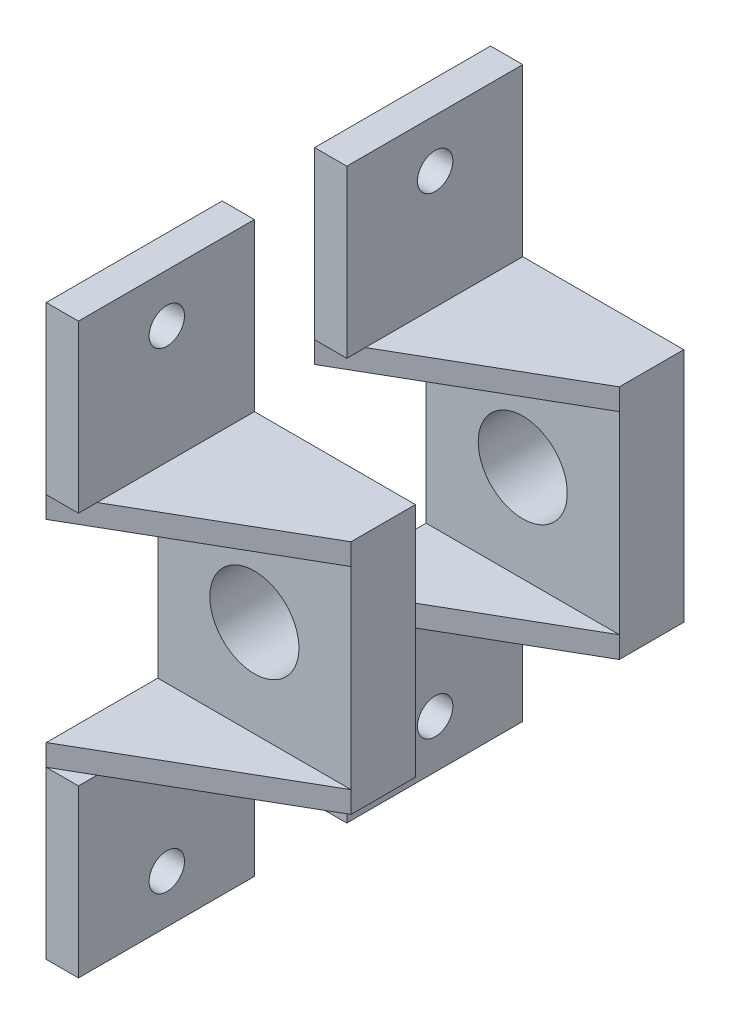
ISO-10303-21;
HEADER;
FILE_DESCRIPTION(('STEP AP214'),'2;1');
FILE_NAME('part.step','',(''),(''),'','','');
FILE_SCHEMA(('AUTOMOTIVE_DESIGN { 1 0 10303 214 1 1 1 1 }'));
ENDSEC;
DATA;
#1=APPLICATION_CONTEXT('core data for automotive mechanical design processes');
#2=APPLICATION_PROTOCOL_DEFINITION('international standard','automotive_design',2000,#1);
#3=PRODUCT_CONTEXT('',#1,'mechanical');
#4=PRODUCT('Part','Part','',(#3));
#5=PRODUCT_RELATED_PRODUCT_CATEGORY('part','',(#4));
#6=PRODUCT_DEFINITION_FORMATION('','',#4);
#7=PRODUCT_DEFINITION_CONTEXT('part definition',#1,'design');
#8=PRODUCT_DEFINITION('design','',#6,#7);
#9=PRODUCT_DEFINITION_SHAPE('','',#8);
#10=(LENGTH_UNIT() NAMED_UNIT(*) SI_UNIT(.MILLI.,.METRE.));
#11=(NAMED_UNIT(*) PLANE_ANGLE_UNIT() SI_UNIT($,.RADIAN.));
#12=(NAMED_UNIT(*) SI_UNIT($,.STERADIAN.) SOLID_ANGLE_UNIT());
#13=UNCERTAINTY_MEASURE_WITH_UNIT(LENGTH_MEASURE(1.E-05),#10,'distance_accuracy_value','');
#14=(GEOMETRIC_REPRESENTATION_CONTEXT(3) GLOBAL_UNCERTAINTY_ASSIGNED_CONTEXT((#13)) GLOBAL_UNIT_ASSIGNED_CONTEXT((#10,
#11,#12)) REPRESENTATION_CONTEXT('',''));
#15=CARTESIAN_POINT('',(0.,0.,0.));
#16=DIRECTION('',(0.,0.,1.));
#17=DIRECTION('',(1.,0.,0.));
#18=AXIS2_PLACEMENT_3D('',#15,#16,#17);
#19=CARTESIAN_POINT('',(24.,11.,-8.));
#20=DIRECTION('',(0.,-1.,0.));
#21=DIRECTION('',(0.,0.,-1.));
#22=AXIS2_PLACEMENT_3D('',#19,#20,#21);
#23=PLANE('',#22);
#24=DIRECTION('',(0.,0.,-1.));
#25=VECTOR('',#24,1.);
#26=CARTESIAN_POINT('',(9.,11.,8.39230484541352));
#27=LINE('',#26,#25);
#28=CARTESIAN_POINT('',(9.,11.,6.66025403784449));
#29=VERTEX_POINT('',#28);
#30=CARTESIAN_POINT('',(9.,11.,-8.));
#31=VERTEX_POINT('',#30);
#32=EDGE_CURVE('E200',#29,#31,#27,.T.);
#33=ORIENTED_EDGE('',*,*,#32,.F.);
#34=DIRECTION('',(0.866025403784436,0.,-0.500000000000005));
#35=VECTOR('',#34,1.);
#36=CARTESIAN_POINT('',(6.,11.,8.39230484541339));
#37=LINE('',#36,#35);
#38=CARTESIAN_POINT('',(24.,11.,-2.));
#39=VERTEX_POINT('',#38);
#40=EDGE_CURVE('E249',#29,#39,#37,.T.);
#41=ORIENTED_EDGE('',*,*,#40,.T.);
#42=DIRECTION('',(0.,0.,1.));
#43=VECTOR('',#42,1.);
#44=CARTESIAN_POINT('',(24.,11.,-8.));
#45=LINE('',#44,#43);
#46=CARTESIAN_POINT('',(24.,11.,-8.));
#47=VERTEX_POINT('',#46);
#48=EDGE_CURVE('E256',#47,#39,#45,.T.);
#49=ORIENTED_EDGE('',*,*,#48,.F.);
#50=DIRECTION('',(-1.,0.,0.));
#51=VECTOR('',#50,1.);
#52=CARTESIAN_POINT('',(24.,11.,-8.));
#53=LINE('',#52,#51);
#54=EDGE_CURVE('E245',#47,#31,#53,.T.);
#55=ORIENTED_EDGE('',*,*,#54,.T.);
#56=EDGE_LOOP('',(#33,#41,#49,#55));
#57=FACE_BOUND('',#56,.T.);
#58=ADVANCED_FACE('F57',(#57),#23,.F.);
#59=CARTESIAN_POINT('',(24.,-11.,-2.));
#60=DIRECTION('',(0.,0.,-1.));
#61=DIRECTION('',(-1.,0.,0.));
#62=AXIS2_PLACEMENT_3D('',#59,#60,#61);
#63=PLANE('',#62);
#64=CARTESIAN_POINT('',(15.,0.,-2.));
#65=DIRECTION('',(0.,0.,-1.));
#66=DIRECTION('',(-1.,0.,0.));
#67=AXIS2_PLACEMENT_3D('',#64,#65,#66);
#68=CIRCLE('',#67,4.15);
#69=CARTESIAN_POINT('',(10.85,0.,-2.));
#70=VERTEX_POINT('',#69);
#71=EDGE_CURVE('E292',#70,#70,#68,.F.);
#72=ORIENTED_EDGE('',*,*,#71,.F.);
#73=EDGE_LOOP('',(#72));
#74=FACE_BOUND('',#73,.T.);
#75=DIRECTION('',(0.,-1.,0.));
#76=VECTOR('',#75,1.);
#77=CARTESIAN_POINT('',(6.,-11.,-2.));
#78=LINE('',#77,#76);
#79=CARTESIAN_POINT('',(6.,9.,-2.));
#80=VERTEX_POINT('',#79);
#81=CARTESIAN_POINT('',(6.,-9.,-2.));
#82=VERTEX_POINT('',#81);
#83=EDGE_CURVE('E248',#80,#82,#78,.T.);
#84=ORIENTED_EDGE('',*,*,#83,.T.);
#85=DIRECTION('',(1.,0.,0.));
#86=VECTOR('',#85,1.);
#87=CARTESIAN_POINT('',(6.,-9.,-2.));
#88=LINE('',#87,#86);
#89=CARTESIAN_POINT('',(24.,-9.,-2.));
#90=VERTEX_POINT('',#89);
#91=EDGE_CURVE('E255',#82,#90,#88,.T.);
#92=ORIENTED_EDGE('',*,*,#91,.T.);
#93=DIRECTION('',(0.,-1.,0.));
#94=VECTOR('',#93,1.);
#95=CARTESIAN_POINT('',(24.,-11.,-2.));
#96=LINE('',#95,#94);
#97=CARTESIAN_POINT('',(24.,9.,-2.));
#98=VERTEX_POINT('',#97);
#99=EDGE_CURVE('E270',#98,#90,#96,.T.);
#100=ORIENTED_EDGE('',*,*,#99,.F.);
#101=DIRECTION('',(-1.,0.,0.));
#102=VECTOR('',#101,1.);
#103=CARTESIAN_POINT('',(24.,9.,-2.));
#104=LINE('',#103,#102);
#105=EDGE_CURVE('E275',#98,#80,#104,.T.);
#106=ORIENTED_EDGE('',*,*,#105,.T.);
#107=EDGE_LOOP('',(#84,#92,#100,#106));
#108=FACE_BOUND('',#107,.T.);
#109=ADVANCED_FACE('F372',(#74,#108),#63,.F.);
#110=CARTESIAN_POINT('',(24.,-11.,-8.));
#111=DIRECTION('',(0.,1.,0.));
#112=DIRECTION('',(0.,0.,1.));
#113=AXIS2_PLACEMENT_3D('',#110,#111,#112);
#114=PLANE('',#113);
#115=DIRECTION('',(-0.866025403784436,0.,0.500000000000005));
#116=VECTOR('',#115,1.);
#117=CARTESIAN_POINT('',(24.,-11.,-2.));
#118=LINE('',#117,#116);
#119=CARTESIAN_POINT('',(24.,-11.,-2.));
#120=VERTEX_POINT('',#119);
#121=CARTESIAN_POINT('',(9.,-11.,6.66025403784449));
#122=VERTEX_POINT('',#121);
#123=EDGE_CURVE('E159',#120,#122,#118,.T.);
#124=ORIENTED_EDGE('',*,*,#123,.T.);
#125=DIRECTION('',(0.,0.,1.));
#126=VECTOR('',#125,1.);
#127=CARTESIAN_POINT('',(9.,-11.,8.39230484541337));
#128=LINE('',#127,#126);
#129=CARTESIAN_POINT('',(9.,-11.,-8.));
#130=VERTEX_POINT('',#129);
#131=EDGE_CURVE('E153',#130,#122,#128,.T.);
#132=ORIENTED_EDGE('',*,*,#131,.F.);
#133=DIRECTION('',(-1.,0.,0.));
#134=VECTOR('',#133,1.);
#135=CARTESIAN_POINT('',(24.,-11.,-8.));
#136=LINE('',#135,#134);
#137=CARTESIAN_POINT('',(24.,-11.,-8.));
#138=VERTEX_POINT('',#137);
#139=EDGE_CURVE('E157',#138,#130,#136,.T.);
#140=ORIENTED_EDGE('',*,*,#139,.F.);
#141=DIRECTION('',(0.,0.,-1.));
#142=VECTOR('',#141,1.);
#143=CARTESIAN_POINT('',(24.,-11.,-8.));
#144=LINE('',#143,#142);
#145=EDGE_CURVE('E263',#120,#138,#144,.T.);
#146=ORIENTED_EDGE('',*,*,#145,.F.);
#147=EDGE_LOOP('',(#124,#132,#140,#146));
#148=FACE_BOUND('',#147,.T.);
#149=ADVANCED_FACE('F155',(#148),#114,.F.);
#150=CARTESIAN_POINT('',(24.,-11.,-8.));
#151=DIRECTION('',(0.,0.,1.));
#152=DIRECTION('',(1.,0.,0.));
#153=AXIS2_PLACEMENT_3D('',#150,#151,#152);
#154=PLANE('',#153);
#155=CARTESIAN_POINT('',(15.,0.,-8.));
#156=DIRECTION('',(0.,0.,-1.));
#157=DIRECTION('',(-1.,0.,0.));
#158=AXIS2_PLACEMENT_3D('',#155,#156,#157);
#159=CIRCLE('',#158,4.15);
#160=CARTESIAN_POINT('',(10.85,0.,-8.));
#161=VERTEX_POINT('',#160);
#162=EDGE_CURVE('E304',#161,#161,#159,.T.);
#163=ORIENTED_EDGE('',*,*,#162,.F.);
#164=EDGE_LOOP('',(#163));
#165=FACE_BOUND('',#164,.T.);
#166=DIRECTION('',(0.,1.,0.));
#167=VECTOR('',#166,1.);
#168=CARTESIAN_POINT('',(6.,-11.,-8.));
#169=LINE('',#168,#167);
#170=CARTESIAN_POINT('',(6.,-26.5,-8.));
#171=VERTEX_POINT('',#170);
#172=CARTESIAN_POINT('',(6.,26.5,-7.99999999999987));
#173=VERTEX_POINT('',#172);
#174=EDGE_CURVE('E75',#171,#173,#169,.T.);
#175=ORIENTED_EDGE('',*,*,#174,.T.);
#176=DIRECTION('',(-1.,0.,0.));
#177=VECTOR('',#176,1.);
#178=CARTESIAN_POINT('',(9.,26.5,-7.99999999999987));
#179=LINE('',#178,#177);
#180=CARTESIAN_POINT('',(9.,26.5,-7.99999999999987));
#181=VERTEX_POINT('',#180);
#182=EDGE_CURVE('E209',#181,#173,#179,.T.);
#183=ORIENTED_EDGE('',*,*,#182,.F.);
#184=DIRECTION('',(0.,1.,0.));
#185=VECTOR('',#184,1.);
#186=CARTESIAN_POINT('',(9.,26.5,-7.99999999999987));
#187=LINE('',#186,#185);
#188=EDGE_CURVE('E201',#31,#181,#187,.T.);
#189=ORIENTED_EDGE('',*,*,#188,.F.);
#190=ORIENTED_EDGE('',*,*,#54,.F.);
#191=DIRECTION('',(0.,1.,0.));
#192=VECTOR('',#191,1.);
#193=CARTESIAN_POINT('',(24.,-11.,-8.));
#194=LINE('',#193,#192);
#195=EDGE_CURVE('E170',#138,#47,#194,.T.);
#196=ORIENTED_EDGE('',*,*,#195,.F.);
#197=ORIENTED_EDGE('',*,*,#139,.T.);
#198=DIRECTION('',(0.,1.,0.));
#199=VECTOR('',#198,1.);
#200=CARTESIAN_POINT('',(9.,-11.,-8.));
#201=LINE('',#200,#199);
#202=CARTESIAN_POINT('',(9.,-26.5,-8.));
#203=VERTEX_POINT('',#202);
#204=EDGE_CURVE('E165',#203,#130,#201,.T.);
#205=ORIENTED_EDGE('',*,*,#204,.F.);
#206=DIRECTION('',(-1.,0.,0.));
#207=VECTOR('',#206,1.);
#208=CARTESIAN_POINT('',(9.,-26.5,-8.));
#209=LINE('',#208,#207);
#210=EDGE_CURVE('E172',#203,#171,#209,.T.);
#211=ORIENTED_EDGE('',*,*,#210,.T.);
#212=EDGE_LOOP('',(#175,#183,#189,#190,#196,#197,#205,#211));
#213=FACE_BOUND('',#212,.T.);
#214=ADVANCED_FACE('F168',(#165,#213),#154,.F.);
#215=CARTESIAN_POINT('',(24.,0.,0.));
#216=DIRECTION('',(1.,0.,0.));
#217=DIRECTION('',(0.,0.,-1.));
#218=AXIS2_PLACEMENT_3D('',#215,#216,#217);
#219=PLANE('',#218);
#220=EDGE_CURVE('E267',#39,#98,#96,.T.);
#221=ORIENTED_EDGE('',*,*,#220,.T.);
#222=ORIENTED_EDGE('',*,*,#99,.T.);
#223=DIRECTION('',(0.,-1.,0.));
#224=VECTOR('',#223,1.);
#225=CARTESIAN_POINT('',(24.,-9.,-2.));
#226=LINE('',#225,#224);
#227=EDGE_CURVE('E266',#90,#120,#226,.T.);
#228=ORIENTED_EDGE('',*,*,#227,.T.);
#229=ORIENTED_EDGE('',*,*,#145,.T.);
#230=ORIENTED_EDGE('',*,*,#195,.T.);
#231=ORIENTED_EDGE('',*,*,#48,.T.);
#232=EDGE_LOOP('',(#221,#222,#228,#229,#230,#231));
#233=FACE_BOUND('',#232,.T.);
#234=ADVANCED_FACE('F370',(#233),#219,.T.);
#235=CARTESIAN_POINT('',(6.,9.,8.39230484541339));
#236=DIRECTION('',(0.500000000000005,0.,0.866025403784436));
#237=DIRECTION('',(0.866025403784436,0.,-0.500000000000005));
#238=AXIS2_PLACEMENT_3D('',#235,#236,#237);
#239=PLANE('',#238);
#240=CARTESIAN_POINT('',(6.,11.,8.39230484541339));
#241=VERTEX_POINT('',#240);
#242=EDGE_CURVE('E221',#241,#29,#37,.T.);
#243=ORIENTED_EDGE('',*,*,#242,.F.);
#244=DIRECTION('',(0.,1.,0.));
#245=VECTOR('',#244,1.);
#246=CARTESIAN_POINT('',(6.,9.,8.39230484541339));
#247=LINE('',#246,#245);
#248=CARTESIAN_POINT('',(6.,9.,8.39230484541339));
#249=VERTEX_POINT('',#248);
#250=EDGE_CURVE('E12',#249,#241,#247,.T.);
#251=ORIENTED_EDGE('',*,*,#250,.F.);
#252=DIRECTION('',(0.866025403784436,0.,-0.500000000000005));
#253=VECTOR('',#252,1.);
#254=CARTESIAN_POINT('',(6.,9.,8.39230484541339));
#255=LINE('',#254,#253);
#256=EDGE_CURVE('E260',#249,#98,#255,.T.);
#257=ORIENTED_EDGE('',*,*,#256,.T.);
#258=ORIENTED_EDGE('',*,*,#220,.F.);
#259=ORIENTED_EDGE('',*,*,#40,.F.);
#260=EDGE_LOOP('',(#243,#251,#257,#258,#259));
#261=FACE_BOUND('',#260,.T.);
#262=ADVANCED_FACE('F362',(#261),#239,.T.);
#263=CARTESIAN_POINT('',(0.,9.,0.));
#264=DIRECTION('',(0.,-1.,0.));
#265=DIRECTION('',(0.,0.,-1.));
#266=AXIS2_PLACEMENT_3D('',#263,#264,#265);
#267=PLANE('',#266);
#268=DIRECTION('',(0.,0.,1.));
#269=VECTOR('',#268,1.);
#270=CARTESIAN_POINT('',(6.,9.,-2.));
#271=LINE('',#270,#269);
#272=EDGE_CURVE('E68',#80,#249,#271,.T.);
#273=ORIENTED_EDGE('',*,*,#272,.F.);
#274=ORIENTED_EDGE('',*,*,#105,.F.);
#275=ORIENTED_EDGE('',*,*,#256,.F.);
#276=EDGE_LOOP('',(#273,#274,#275));
#277=FACE_BOUND('',#276,.T.);
#278=ADVANCED_FACE('F378',(#277),#267,.T.);
#279=CARTESIAN_POINT('',(24.,-9.,-2.));
#280=DIRECTION('',(0.500000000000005,0.,0.866025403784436));
#281=DIRECTION('',(0.866025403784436,0.,-0.500000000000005));
#282=AXIS2_PLACEMENT_3D('',#279,#280,#281);
#283=PLANE('',#282);
#284=ORIENTED_EDGE('',*,*,#123,.F.);
#285=ORIENTED_EDGE('',*,*,#227,.F.);
#286=DIRECTION('',(-0.866025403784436,0.,0.500000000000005));
#287=VECTOR('',#286,1.);
#288=CARTESIAN_POINT('',(24.,-9.,-2.));
#289=LINE('',#288,#287);
#290=CARTESIAN_POINT('',(6.,-9.,8.39230484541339));
#291=VERTEX_POINT('',#290);
#292=EDGE_CURVE('E282',#90,#291,#289,.T.);
#293=ORIENTED_EDGE('',*,*,#292,.T.);
#294=DIRECTION('',(0.,-1.,0.));
#295=VECTOR('',#294,1.);
#296=CARTESIAN_POINT('',(6.,-9.,8.39230484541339));
#297=LINE('',#296,#295);
#298=CARTESIAN_POINT('',(6.,-11.,8.39230484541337));
#299=VERTEX_POINT('',#298);
#300=EDGE_CURVE('E288',#291,#299,#297,.T.);
#301=ORIENTED_EDGE('',*,*,#300,.T.);
#302=EDGE_CURVE('E187',#122,#299,#118,.T.);
#303=ORIENTED_EDGE('',*,*,#302,.F.);
#304=EDGE_LOOP('',(#284,#285,#293,#301,#303));
#305=FACE_BOUND('',#304,.T.);
#306=ADVANCED_FACE('F334',(#305),#283,.T.);
#307=CARTESIAN_POINT('',(0.,-9.,0.));
#308=DIRECTION('',(0.,1.,0.));
#309=DIRECTION('',(0.,0.,1.));
#310=AXIS2_PLACEMENT_3D('',#307,#308,#309);
#311=PLANE('',#310);
#312=ORIENTED_EDGE('',*,*,#91,.F.);
#313=DIRECTION('',(0.,0.,-1.));
#314=VECTOR('',#313,1.);
#315=CARTESIAN_POINT('',(6.,-9.,8.39230484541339));
#316=LINE('',#315,#314);
#317=EDGE_CURVE('E235',#291,#82,#316,.T.);
#318=ORIENTED_EDGE('',*,*,#317,.F.);
#319=ORIENTED_EDGE('',*,*,#292,.F.);
#320=EDGE_LOOP('',(#312,#318,#319));
#321=FACE_BOUND('',#320,.T.);
#322=ADVANCED_FACE('F375',(#321),#311,.T.);
#323=CARTESIAN_POINT('',(15.,0.,9.73797256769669));
#324=DIRECTION('',(0.,0.,-1.));
#325=DIRECTION('',(-1.,0.,0.));
#326=AXIS2_PLACEMENT_3D('',#323,#324,#325);
#327=CYLINDRICAL_SURFACE('',#326,4.15);
#328=CARTESIAN_POINT('',(10.85,0.,-2.));
#329=CARTESIAN_POINT('',(10.85,0.,-2.0625));
#330=CARTESIAN_POINT('',(10.85,0.,-2.125));
#331=CARTESIAN_POINT('',(10.85,0.,-2.25));
#332=CARTESIAN_POINT('',(10.85,0.,-2.3125));
#333=CARTESIAN_POINT('',(10.85,0.,-2.4375));
#334=CARTESIAN_POINT('',(10.85,0.,-2.5));
#335=CARTESIAN_POINT('',(10.85,0.,-2.625));
#336=CARTESIAN_POINT('',(10.85,0.,-2.6875));
#337=CARTESIAN_POINT('',(10.85,0.,-2.8125));
#338=CARTESIAN_POINT('',(10.85,0.,-2.875));
#339=CARTESIAN_POINT('',(10.85,0.,-3.));
#340=CARTESIAN_POINT('',(10.85,0.,-3.0625));
#341=CARTESIAN_POINT('',(10.85,0.,-3.1875));
#342=CARTESIAN_POINT('',(10.85,0.,-3.25));
#343=CARTESIAN_POINT('',(10.85,0.,-3.375));
#344=CARTESIAN_POINT('',(10.85,0.,-3.4375));
#345=CARTESIAN_POINT('',(10.85,0.,-3.5625));
#346=CARTESIAN_POINT('',(10.85,0.,-3.625));
#347=CARTESIAN_POINT('',(10.85,0.,-3.75));
#348=CARTESIAN_POINT('',(10.85,0.,-3.8125));
#349=CARTESIAN_POINT('',(10.85,0.,-3.9375));
#350=CARTESIAN_POINT('',(10.85,0.,-4.));
#351=CARTESIAN_POINT('',(10.85,0.,-4.125));
#352=CARTESIAN_POINT('',(10.85,0.,-4.1875));
#353=CARTESIAN_POINT('',(10.85,0.,-4.3125));
#354=CARTESIAN_POINT('',(10.85,0.,-4.375));
#355=CARTESIAN_POINT('',(10.85,0.,-4.5));
#356=CARTESIAN_POINT('',(10.85,0.,-4.5625));
#357=CARTESIAN_POINT('',(10.85,0.,-4.6875));
#358=CARTESIAN_POINT('',(10.85,0.,-4.75));
#359=CARTESIAN_POINT('',(10.85,0.,-4.875));
#360=CARTESIAN_POINT('',(10.85,0.,-4.9375));
#361=CARTESIAN_POINT('',(10.85,0.,-5.0625));
#362=CARTESIAN_POINT('',(10.85,0.,-5.125));
#363=CARTESIAN_POINT('',(10.85,0.,-5.25));
#364=CARTESIAN_POINT('',(10.85,0.,-5.3125));
#365=CARTESIAN_POINT('',(10.85,0.,-5.4375));
#366=CARTESIAN_POINT('',(10.85,0.,-5.5));
#367=CARTESIAN_POINT('',(10.85,0.,-5.625));
#368=CARTESIAN_POINT('',(10.85,0.,-5.6875));
#369=CARTESIAN_POINT('',(10.85,0.,-5.8125));
#370=CARTESIAN_POINT('',(10.85,0.,-5.875));
#371=CARTESIAN_POINT('',(10.85,0.,-6.));
#372=CARTESIAN_POINT('',(10.85,0.,-6.0625));
#373=CARTESIAN_POINT('',(10.85,0.,-6.1875));
#374=CARTESIAN_POINT('',(10.85,0.,-6.25));
#375=CARTESIAN_POINT('',(10.85,0.,-6.375));
#376=CARTESIAN_POINT('',(10.85,0.,-6.4375));
#377=CARTESIAN_POINT('',(10.85,0.,-6.5625));
#378=CARTESIAN_POINT('',(10.85,0.,-6.625));
#379=CARTESIAN_POINT('',(10.85,0.,-6.75));
#380=CARTESIAN_POINT('',(10.85,0.,-6.8125));
#381=CARTESIAN_POINT('',(10.85,0.,-6.9375));
#382=CARTESIAN_POINT('',(10.85,0.,-7.));
#383=CARTESIAN_POINT('',(10.85,0.,-7.125));
#384=CARTESIAN_POINT('',(10.85,0.,-7.1875));
#385=CARTESIAN_POINT('',(10.85,0.,-7.3125));
#386=CARTESIAN_POINT('',(10.85,0.,-7.375));
#387=CARTESIAN_POINT('',(10.85,0.,-7.5));
#388=CARTESIAN_POINT('',(10.85,0.,-7.5625));
#389=CARTESIAN_POINT('',(10.85,0.,-7.6875));
#390=CARTESIAN_POINT('',(10.85,0.,-7.75));
#391=CARTESIAN_POINT('',(10.85,0.,-7.875));
#392=CARTESIAN_POINT('',(10.85,0.,-7.9375));
#393=CARTESIAN_POINT('',(10.85,0.,-8.));
#394=B_SPLINE_CURVE_WITH_KNOTS('',3,(#328,#329,#330,#331,#332,#333,#334,#335,#336,#337,#338,
#339,#340,#341,#342,#343,#344,#345,#346,#347,#348,#349,#350,#351,#352,#353,#354,#355,#356,#357,
#358,#359,#360,#361,#362,#363,#364,#365,#366,#367,#368,#369,#370,#371,#372,#373,#374,#375,#376,
#377,#378,#379,#380,#381,#382,#383,#384,#385,#386,#387,#388,#389,#390,#391,#392,#393),
.UNSPECIFIED.,.F.,.F.,(4,2,2,2,2,2,2,2,2,2,2,2,2,2,2,2,2,2,2,2,2,2,2,2,2,2,2,2,2,2,2,2,4),(0.,
0.1875,0.375,0.5625,0.750000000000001,0.937500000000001,1.125,1.3125,1.5,1.6875,1.875,2.0625,
2.25,2.4375,2.625,2.8125,3.,3.1875,3.375,3.5625,3.75,3.9375,4.125,4.3125,4.5,4.6875,4.875,
5.0625,5.25,5.4375,5.625,5.8125,6.),.UNSPECIFIED.);
#395=EDGE_CURVE('BSEAM407',#70,#161,#394,.T.);
#396=ORIENTED_EDGE('',*,*,#71,.T.);
#397=ORIENTED_EDGE('',*,*,#162,.T.);
#398=ORIENTED_EDGE('',*,*,#395,.T.);
#399=ORIENTED_EDGE('',*,*,#395,.F.);
#400=EDGE_LOOP('',(#396,#398,#397,#399));
#401=FACE_BOUND('',#400,.T.);
#402=ADVANCED_FACE('F407',(#401),#327,.F.);
#403=CARTESIAN_POINT('',(9.,-11.,8.39230484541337));
#404=DIRECTION('',(0.,0.,-1.));
#405=DIRECTION('',(0.,1.,0.));
#406=AXIS2_PLACEMENT_3D('',#403,#404,#405);
#407=PLANE('',#406);
#408=DIRECTION('',(0.,-1.,0.));
#409=VECTOR('',#408,1.);
#410=CARTESIAN_POINT('',(6.,-11.,8.39230484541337));
#411=LINE('',#410,#409);
#412=CARTESIAN_POINT('',(6.,-26.5,8.39230484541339));
#413=VERTEX_POINT('',#412);
#414=EDGE_CURVE('E308',#299,#413,#411,.T.);
#415=ORIENTED_EDGE('',*,*,#414,.T.);
#416=DIRECTION('',(-1.,0.,0.));
#417=VECTOR('',#416,1.);
#418=CARTESIAN_POINT('',(9.,-26.5,8.39230484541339));
#419=LINE('',#418,#417);
#420=CARTESIAN_POINT('',(9.,-26.5,8.39230484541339));
#421=VERTEX_POINT('',#420);
#422=EDGE_CURVE('E309',#421,#413,#419,.T.);
#423=ORIENTED_EDGE('',*,*,#422,.F.);
#424=DIRECTION('',(0.,-1.,0.));
#425=VECTOR('',#424,1.);
#426=CARTESIAN_POINT('',(9.,-11.,8.39230484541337));
#427=LINE('',#426,#425);
#428=CARTESIAN_POINT('',(9.,-11.,8.39230484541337));
#429=VERTEX_POINT('',#428);
#430=EDGE_CURVE('E181',#429,#421,#427,.T.);
#431=ORIENTED_EDGE('',*,*,#430,.F.);
#432=DIRECTION('',(-1.,0.,0.));
#433=VECTOR('',#432,1.);
#434=CARTESIAN_POINT('',(9.,-11.,8.39230484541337));
#435=LINE('',#434,#433);
#436=EDGE_CURVE('E316',#429,#299,#435,.T.);
#437=ORIENTED_EDGE('',*,*,#436,.T.);
#438=EDGE_LOOP('',(#415,#423,#431,#437));
#439=FACE_BOUND('',#438,.T.);
#440=ADVANCED_FACE('F326',(#439),#407,.F.);
#441=CARTESIAN_POINT('',(9.,-26.5,8.39230484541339));
#442=DIRECTION('',(0.,1.,0.));
#443=DIRECTION('',(0.,0.,1.));
#444=AXIS2_PLACEMENT_3D('',#441,#442,#443);
#445=PLANE('',#444);
#446=DIRECTION('',(0.,0.,-1.));
#447=VECTOR('',#446,1.);
#448=CARTESIAN_POINT('',(6.,-26.5,8.39230484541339));
#449=LINE('',#448,#447);
#450=EDGE_CURVE('E313',#413,#171,#449,.T.);
#451=ORIENTED_EDGE('',*,*,#450,.T.);
#452=ORIENTED_EDGE('',*,*,#210,.F.);
#453=DIRECTION('',(0.,0.,-1.));
#454=VECTOR('',#453,1.);
#455=CARTESIAN_POINT('',(9.,-26.5,8.39230484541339));
#456=LINE('',#455,#454);
#457=EDGE_CURVE('E176',#421,#203,#456,.T.);
#458=ORIENTED_EDGE('',*,*,#457,.F.);
#459=ORIENTED_EDGE('',*,*,#422,.T.);
#460=EDGE_LOOP('',(#451,#452,#458,#459));
#461=FACE_BOUND('',#460,.T.);
#462=ADVANCED_FACE('F415',(#461),#445,.F.);
#463=CARTESIAN_POINT('',(9.,-11.,8.39230484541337));
#464=DIRECTION('',(0.,-1.,0.));
#465=DIRECTION('',(0.,0.,-1.));
#466=AXIS2_PLACEMENT_3D('',#463,#464,#465);
#467=PLANE('',#466);
#468=ORIENTED_EDGE('',*,*,#302,.T.);
#469=ORIENTED_EDGE('',*,*,#436,.F.);
#470=EDGE_CURVE('E164',#122,#429,#128,.T.);
#471=ORIENTED_EDGE('',*,*,#470,.F.);
#472=EDGE_LOOP('',(#468,#469,#471));
#473=FACE_BOUND('',#472,.T.);
#474=ADVANCED_FACE('F338',(#473),#467,.F.);
#475=CARTESIAN_POINT('',(9.,0.,0.));
#476=DIRECTION('',(1.,0.,0.));
#477=DIRECTION('',(0.,0.,-1.));
#478=AXIS2_PLACEMENT_3D('',#475,#476,#477);
#479=PLANE('',#478);
#480=CARTESIAN_POINT('',(9.,-22.,0.160287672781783));
#481=DIRECTION('',(1.,0.,0.));
#482=DIRECTION('',(0.,0.,-1.));
#483=AXIS2_PLACEMENT_3D('',#480,#481,#482);
#484=CIRCLE('',#483,1.6499999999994);
#485=CARTESIAN_POINT('',(9.,-22.,-1.48971232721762));
#486=VERTEX_POINT('',#485);
#487=EDGE_CURVE('E230',#486,#486,#484,.T.);
#488=ORIENTED_EDGE('',*,*,#487,.F.);
#489=EDGE_LOOP('',(#488));
#490=FACE_BOUND('',#489,.T.);
#491=ORIENTED_EDGE('',*,*,#430,.T.);
#492=ORIENTED_EDGE('',*,*,#457,.T.);
#493=ORIENTED_EDGE('',*,*,#204,.T.);
#494=ORIENTED_EDGE('',*,*,#131,.T.);
#495=ORIENTED_EDGE('',*,*,#470,.T.);
#496=EDGE_LOOP('',(#491,#492,#493,#494,#495));
#497=FACE_BOUND('',#496,.T.);
#498=ADVANCED_FACE('F175',(#490,#497),#479,.T.);
#499=CARTESIAN_POINT('',(9.,26.5,8.39230484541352));
#500=DIRECTION('',(0.,-1.,0.));
#501=DIRECTION('',(0.,0.,-1.));
#502=AXIS2_PLACEMENT_3D('',#499,#500,#501);
#503=PLANE('',#502);
#504=DIRECTION('',(0.,0.,1.));
#505=VECTOR('',#504,1.);
#506=CARTESIAN_POINT('',(6.,26.5,8.39230484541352));
#507=LINE('',#506,#505);
#508=CARTESIAN_POINT('',(6.,26.5,8.39230484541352));
#509=VERTEX_POINT('',#508);
#510=EDGE_CURVE('E205',#173,#509,#507,.T.);
#511=ORIENTED_EDGE('',*,*,#510,.T.);
#512=DIRECTION('',(-1.,0.,0.));
#513=VECTOR('',#512,1.);
#514=CARTESIAN_POINT('',(9.,26.5,8.39230484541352));
#515=LINE('',#514,#513);
#516=CARTESIAN_POINT('',(9.,26.5,8.39230484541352));
#517=VERTEX_POINT('',#516);
#518=EDGE_CURVE('E213',#517,#509,#515,.T.);
#519=ORIENTED_EDGE('',*,*,#518,.F.);
#520=DIRECTION('',(0.,0.,1.));
#521=VECTOR('',#520,1.);
#522=CARTESIAN_POINT('',(9.,26.5,8.39230484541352));
#523=LINE('',#522,#521);
#524=EDGE_CURVE('E188',#181,#517,#523,.T.);
#525=ORIENTED_EDGE('',*,*,#524,.F.);
#526=ORIENTED_EDGE('',*,*,#182,.T.);
#527=EDGE_LOOP('',(#511,#519,#525,#526));
#528=FACE_BOUND('',#527,.T.);
#529=ADVANCED_FACE('F353',(#528),#503,.F.);
#530=CARTESIAN_POINT('',(9.,26.5,8.39230484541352));
#531=DIRECTION('',(0.,0.,-1.));
#532=DIRECTION('',(0.,1.,0.));
#533=AXIS2_PLACEMENT_3D('',#530,#531,#532);
#534=PLANE('',#533);
#535=DIRECTION('',(0.,-1.,0.));
#536=VECTOR('',#535,1.);
#537=CARTESIAN_POINT('',(6.,26.5,8.39230484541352));
#538=LINE('',#537,#536);
#539=EDGE_CURVE('E210',#509,#241,#538,.T.);
#540=ORIENTED_EDGE('',*,*,#539,.T.);
#541=DIRECTION('',(-1.,0.,0.));
#542=VECTOR('',#541,1.);
#543=CARTESIAN_POINT('',(9.,11.,8.39230484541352));
#544=LINE('',#543,#542);
#545=CARTESIAN_POINT('',(9.,11.,8.39230484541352));
#546=VERTEX_POINT('',#545);
#547=EDGE_CURVE('E217',#546,#241,#544,.T.);
#548=ORIENTED_EDGE('',*,*,#547,.F.);
#549=DIRECTION('',(0.,-1.,0.));
#550=VECTOR('',#549,1.);
#551=CARTESIAN_POINT('',(9.,26.5,8.39230484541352));
#552=LINE('',#551,#550);
#553=EDGE_CURVE('E192',#517,#546,#552,.T.);
#554=ORIENTED_EDGE('',*,*,#553,.F.);
#555=ORIENTED_EDGE('',*,*,#518,.T.);
#556=EDGE_LOOP('',(#540,#548,#554,#555));
#557=FACE_BOUND('',#556,.T.);
#558=ADVANCED_FACE('F356',(#557),#534,.F.);
#559=CARTESIAN_POINT('',(9.,11.,8.39230484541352));
#560=DIRECTION('',(0.,1.,0.));
#561=DIRECTION('',(0.,0.,1.));
#562=AXIS2_PLACEMENT_3D('',#559,#560,#561);
#563=PLANE('',#562);
#564=ORIENTED_EDGE('',*,*,#242,.T.);
#565=EDGE_CURVE('E196',#546,#29,#27,.T.);
#566=ORIENTED_EDGE('',*,*,#565,.F.);
#567=ORIENTED_EDGE('',*,*,#547,.T.);
#568=EDGE_LOOP('',(#564,#566,#567));
#569=FACE_BOUND('',#568,.T.);
#570=ADVANCED_FACE('F358',(#569),#563,.F.);
#571=CARTESIAN_POINT('',(9.,0.,0.));
#572=DIRECTION('',(-1.,0.,0.));
#573=DIRECTION('',(0.,0.,1.));
#574=AXIS2_PLACEMENT_3D('',#571,#572,#573);
#575=PLANE('',#574);
#576=CARTESIAN_POINT('',(9.,22.,0.160287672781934));
#577=DIRECTION('',(-1.,0.,0.));
#578=DIRECTION('',(0.,0.,1.));
#579=AXIS2_PLACEMENT_3D('',#576,#577,#578);
#580=CIRCLE('',#579,1.6499999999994);
#581=CARTESIAN_POINT('',(9.,22.,1.81028767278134));
#582=VERTEX_POINT('',#581);
#583=EDGE_CURVE('E193',#582,#582,#580,.T.);
#584=ORIENTED_EDGE('',*,*,#583,.T.);
#585=EDGE_LOOP('',(#584));
#586=FACE_BOUND('',#585,.T.);
#587=ORIENTED_EDGE('',*,*,#524,.T.);
#588=ORIENTED_EDGE('',*,*,#553,.T.);
#589=ORIENTED_EDGE('',*,*,#565,.T.);
#590=ORIENTED_EDGE('',*,*,#32,.T.);
#591=ORIENTED_EDGE('',*,*,#188,.T.);
#592=EDGE_LOOP('',(#587,#588,#589,#590,#591));
#593=FACE_BOUND('',#592,.T.);
#594=ADVANCED_FACE('F346',(#586,#593),#575,.F.);
#595=CARTESIAN_POINT('',(6.,0.,0.));
#596=DIRECTION('',(-1.,0.,0.));
#597=DIRECTION('',(0.,0.,1.));
#598=AXIS2_PLACEMENT_3D('',#595,#596,#597);
#599=PLANE('',#598);
#600=ORIENTED_EDGE('',*,*,#250,.T.);
#601=ORIENTED_EDGE('',*,*,#539,.F.);
#602=ORIENTED_EDGE('',*,*,#510,.F.);
#603=ORIENTED_EDGE('',*,*,#174,.F.);
#604=ORIENTED_EDGE('',*,*,#450,.F.);
#605=ORIENTED_EDGE('',*,*,#414,.F.);
#606=ORIENTED_EDGE('',*,*,#300,.F.);
#607=ORIENTED_EDGE('',*,*,#317,.T.);
#608=ORIENTED_EDGE('',*,*,#83,.F.);
#609=ORIENTED_EDGE('',*,*,#272,.T.);
#610=EDGE_LOOP('',(#600,#601,#602,#603,#604,#605,#606,#607,#608,#609));
#611=FACE_BOUND('',#610,.T.);
#612=CARTESIAN_POINT('',(6.,-22.,0.160287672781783));
#613=DIRECTION('',(1.,0.,0.));
#614=DIRECTION('',(0.,0.,-1.));
#615=AXIS2_PLACEMENT_3D('',#612,#613,#614);
#616=CIRCLE('',#615,1.6499999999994);
#617=CARTESIAN_POINT('',(6.,-22.,-1.48971232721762));
#618=VERTEX_POINT('',#617);
#619=EDGE_CURVE('E61',#618,#618,#616,.F.);
#620=ORIENTED_EDGE('',*,*,#619,.F.);
#621=EDGE_LOOP('',(#620));
#622=FACE_BOUND('',#621,.T.);
#623=CARTESIAN_POINT('',(6.,22.,0.160287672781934));
#624=DIRECTION('',(1.,0.,0.));
#625=DIRECTION('',(0.,0.,-1.));
#626=AXIS2_PLACEMENT_3D('',#623,#624,#625);
#627=CIRCLE('',#626,1.6499999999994);
#628=CARTESIAN_POINT('',(6.,22.,-1.48971232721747));
#629=VERTEX_POINT('',#628);
#630=EDGE_CURVE('E204',#629,#629,#627,.F.);
#631=ORIENTED_EDGE('',*,*,#630,.F.);
#632=EDGE_LOOP('',(#631));
#633=FACE_BOUND('',#632,.T.);
#634=ADVANCED_FACE('F330',(#611,#622,#633),#599,.T.);
#635=CARTESIAN_POINT('',(0.,22.,0.160287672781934));
#636=DIRECTION('',(1.,0.,0.));
#637=DIRECTION('',(0.,0.,-1.));
#638=AXIS2_PLACEMENT_3D('',#635,#636,#637);
#639=CYLINDRICAL_SURFACE('',#638,1.6499999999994);
#640=ORIENTED_EDGE('',*,*,#630,.T.);
#641=EDGE_LOOP('',(#640));
#642=FACE_BOUND('',#641,.T.);
#643=ORIENTED_EDGE('',*,*,#583,.F.);
#644=EDGE_LOOP('',(#643));
#645=FACE_BOUND('',#644,.T.);
#646=ADVANCED_FACE('F59',(#642,#645),#639,.F.);
#647=CARTESIAN_POINT('',(0.,-22.,0.160287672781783));
#648=DIRECTION('',(1.,0.,0.));
#649=DIRECTION('',(0.,0.,-1.));
#650=AXIS2_PLACEMENT_3D('',#647,#648,#649);
#651=CYLINDRICAL_SURFACE('',#650,1.6499999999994);
#652=ORIENTED_EDGE('',*,*,#619,.T.);
#653=EDGE_LOOP('',(#652));
#654=FACE_BOUND('',#653,.T.);
#655=ORIENTED_EDGE('',*,*,#487,.T.);
#656=EDGE_LOOP('',(#655));
#657=FACE_BOUND('',#656,.T.);
#658=ADVANCED_FACE('F437',(#654,#657),#651,.F.);
#659=CLOSED_SHELL('',(#58,#109,#149,#214,#234,#262,#278,#306,#322,#402,#440,#462,#474,#498,#529,
#558,#570,#594,#634,#646,#658));
#660=MANIFOLD_SOLID_BREP('B2',#659);
#661=CARTESIAN_POINT('',(15.,0.,47.7379725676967));
#662=DIRECTION('',(0.,0.,-1.));
#663=DIRECTION('',(-1.,0.,0.));
#664=AXIS2_PLACEMENT_3D('',#661,#662,#663);
#665=CYLINDRICAL_SURFACE('',#664,4.15);
#666=CARTESIAN_POINT('',(15.,0.,23.));
#667=DIRECTION('',(0.,0.,-1.));
#668=DIRECTION('',(-1.,0.,0.));
#669=AXIS2_PLACEMENT_3D('',#666,#667,#668);
#670=CIRCLE('',#669,4.15);
#671=CARTESIAN_POINT('',(10.85,0.,23.));
#672=VERTEX_POINT('',#671);
#673=EDGE_CURVE('E721',#672,#672,#670,.F.);
#674=ORIENTED_EDGE('',*,*,#673,.T.);
#675=EDGE_LOOP('',(#674));
#676=FACE_BOUND('',#675,.T.);
#677=CARTESIAN_POINT('',(15.,0.,17.));
#678=DIRECTION('',(0.,0.,-1.));
#679=DIRECTION('',(-1.,0.,0.));
#680=AXIS2_PLACEMENT_3D('',#677,#678,#679);
#681=CIRCLE('',#680,4.15);
#682=CARTESIAN_POINT('',(10.85,0.,17.));
#683=VERTEX_POINT('',#682);
#684=EDGE_CURVE('E718',#683,#683,#681,.T.);
#685=ORIENTED_EDGE('',*,*,#684,.T.);
#686=EDGE_LOOP('',(#685));
#687=FACE_BOUND('',#686,.T.);
#688=ADVANCED_FACE('F578',(#676,#687),#665,.F.);
#689=CARTESIAN_POINT('',(24.,11.,17.));
#690=DIRECTION('',(0.,-1.,0.));
#691=DIRECTION('',(0.,0.,-1.));
#692=AXIS2_PLACEMENT_3D('',#689,#690,#691);
#693=PLANE('',#692);
#694=DIRECTION('',(0.,0.,-1.));
#695=VECTOR('',#694,1.);
#696=CARTESIAN_POINT('',(9.,10.9999999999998,33.3923048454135));
#697=LINE('',#696,#695);
#698=CARTESIAN_POINT('',(9.,10.9999999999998,31.6602540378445));
#699=VERTEX_POINT('',#698);
#700=CARTESIAN_POINT('',(9.,11.,17.));
#701=VERTEX_POINT('',#700);
#702=EDGE_CURVE('E712',#699,#701,#697,.T.);
#703=ORIENTED_EDGE('',*,*,#702,.F.);
#704=DIRECTION('',(0.866025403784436,0.,-0.500000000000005));
#705=VECTOR('',#704,1.);
#706=CARTESIAN_POINT('',(6.,11.,33.3923048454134));
#707=LINE('',#706,#705);
#708=CARTESIAN_POINT('',(24.,11.,23.));
#709=VERTEX_POINT('',#708);
#710=EDGE_CURVE('E740',#699,#709,#707,.T.);
#711=ORIENTED_EDGE('',*,*,#710,.T.);
#712=DIRECTION('',(0.,0.,1.));
#713=VECTOR('',#712,1.);
#714=CARTESIAN_POINT('',(24.,11.,17.));
#715=LINE('',#714,#713);
#716=CARTESIAN_POINT('',(24.,11.,17.));
#717=VERTEX_POINT('',#716);
#718=EDGE_CURVE('E764',#717,#709,#715,.T.);
#719=ORIENTED_EDGE('',*,*,#718,.F.);
#720=DIRECTION('',(-1.,0.,0.));
#721=VECTOR('',#720,1.);
#722=CARTESIAN_POINT('',(24.,11.,17.));
#723=LINE('',#722,#721);
#724=EDGE_CURVE('E587',#717,#701,#723,.T.);
#725=ORIENTED_EDGE('',*,*,#724,.T.);
#726=EDGE_LOOP('',(#703,#711,#719,#725));
#727=FACE_BOUND('',#726,.T.);
#728=ADVANCED_FACE('F851',(#727),#693,.F.);
#729=CARTESIAN_POINT('',(24.,0.,25.));
#730=DIRECTION('',(1.,0.,0.));
#731=DIRECTION('',(0.,0.,-1.));
#732=AXIS2_PLACEMENT_3D('',#729,#730,#731);
#733=PLANE('',#732);
#734=DIRECTION('',(0.,-1.,0.));
#735=VECTOR('',#734,1.);
#736=CARTESIAN_POINT('',(24.,-11.,23.));
#737=LINE('',#736,#735);
#738=CARTESIAN_POINT('',(24.,9.,23.));
#739=VERTEX_POINT('',#738);
#740=EDGE_CURVE('E756',#709,#739,#737,.T.);
#741=ORIENTED_EDGE('',*,*,#740,.T.);
#742=CARTESIAN_POINT('',(24.,-9.,23.));
#743=VERTEX_POINT('',#742);
#744=EDGE_CURVE('E760',#739,#743,#737,.T.);
#745=ORIENTED_EDGE('',*,*,#744,.T.);
#746=DIRECTION('',(0.,-1.,0.));
#747=VECTOR('',#746,1.);
#748=CARTESIAN_POINT('',(24.,-9.,23.));
#749=LINE('',#748,#747);
#750=CARTESIAN_POINT('',(24.,-11.,23.));
#751=VERTEX_POINT('',#750);
#752=EDGE_CURVE('E735',#743,#751,#749,.T.);
#753=ORIENTED_EDGE('',*,*,#752,.T.);
#754=DIRECTION('',(0.,0.,-1.));
#755=VECTOR('',#754,1.);
#756=CARTESIAN_POINT('',(24.,-11.,17.));
#757=LINE('',#756,#755);
#758=CARTESIAN_POINT('',(24.,-11.,17.));
#759=VERTEX_POINT('',#758);
#760=EDGE_CURVE('E759',#751,#759,#757,.T.);
#761=ORIENTED_EDGE('',*,*,#760,.T.);
#762=DIRECTION('',(0.,1.,0.));
#763=VECTOR('',#762,1.);
#764=CARTESIAN_POINT('',(24.,-11.,17.));
#765=LINE('',#764,#763);
#766=EDGE_CURVE('E762',#759,#717,#765,.T.);
#767=ORIENTED_EDGE('',*,*,#766,.T.);
#768=ORIENTED_EDGE('',*,*,#718,.T.);
#769=EDGE_LOOP('',(#741,#745,#753,#761,#767,#768));
#770=FACE_BOUND('',#769,.T.);
#771=ADVANCED_FACE('F837',(#770),#733,.T.);
#772=CARTESIAN_POINT('',(24.,-11.,17.));
#773=DIRECTION('',(0.,1.,0.));
#774=DIRECTION('',(0.,0.,1.));
#775=AXIS2_PLACEMENT_3D('',#772,#773,#774);
#776=PLANE('',#775);
#777=DIRECTION('',(0.,0.,1.));
#778=VECTOR('',#777,1.);
#779=CARTESIAN_POINT('',(9.,-11.0000000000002,33.3923048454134));
#780=LINE('',#779,#778);
#781=CARTESIAN_POINT('',(9.,-11.,17.));
#782=VERTEX_POINT('',#781);
#783=CARTESIAN_POINT('',(9.,-11.,31.6602540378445));
#784=VERTEX_POINT('',#783);
#785=EDGE_CURVE('E595',#782,#784,#780,.T.);
#786=ORIENTED_EDGE('',*,*,#785,.F.);
#787=DIRECTION('',(-1.,0.,0.));
#788=VECTOR('',#787,1.);
#789=CARTESIAN_POINT('',(24.,-11.,17.));
#790=LINE('',#789,#788);
#791=EDGE_CURVE('E55',#759,#782,#790,.T.);
#792=ORIENTED_EDGE('',*,*,#791,.F.);
#793=ORIENTED_EDGE('',*,*,#760,.F.);
#794=DIRECTION('',(-0.866025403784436,0.,0.500000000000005));
#795=VECTOR('',#794,1.);
#796=CARTESIAN_POINT('',(24.,-11.,23.));
#797=LINE('',#796,#795);
#798=EDGE_CURVE('E730',#751,#784,#797,.T.);
#799=ORIENTED_EDGE('',*,*,#798,.T.);
#800=EDGE_LOOP('',(#786,#792,#793,#799));
#801=FACE_BOUND('',#800,.T.);
#802=ADVANCED_FACE('F835',(#801),#776,.F.);
#803=CARTESIAN_POINT('',(9.,-11.0000000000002,33.3923048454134));
#804=DIRECTION('',(0.,-1.,0.));
#805=DIRECTION('',(0.,0.,-1.));
#806=AXIS2_PLACEMENT_3D('',#803,#804,#805);
#807=PLANE('',#806);
#808=CARTESIAN_POINT('',(6.,-11.0000000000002,33.3923048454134));
#809=VERTEX_POINT('',#808);
#810=EDGE_CURVE('E725',#784,#809,#797,.T.);
#811=ORIENTED_EDGE('',*,*,#810,.T.);
#812=DIRECTION('',(-1.,0.,0.));
#813=VECTOR('',#812,1.);
#814=CARTESIAN_POINT('',(9.,-11.0000000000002,33.3923048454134));
#815=LINE('',#814,#813);
#816=CARTESIAN_POINT('',(9.,-11.0000000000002,33.3923048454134));
#817=VERTEX_POINT('',#816);
#818=EDGE_CURVE('E703',#817,#809,#815,.T.);
#819=ORIENTED_EDGE('',*,*,#818,.F.);
#820=EDGE_CURVE('E802',#784,#817,#780,.T.);
#821=ORIENTED_EDGE('',*,*,#820,.F.);
#822=EDGE_LOOP('',(#811,#819,#821));
#823=FACE_BOUND('',#822,.T.);
#824=ADVANCED_FACE('F830',(#823),#807,.F.);
#825=CARTESIAN_POINT('',(0.,9.,25.));
#826=DIRECTION('',(0.,-1.,0.));
#827=DIRECTION('',(0.,0.,-1.));
#828=AXIS2_PLACEMENT_3D('',#825,#826,#827);
#829=PLANE('',#828);
#830=DIRECTION('',(0.,0.,1.));
#831=VECTOR('',#830,1.);
#832=CARTESIAN_POINT('',(6.,9.,23.));
#833=LINE('',#832,#831);
#834=CARTESIAN_POINT('',(6.,9.,23.));
#835=VERTEX_POINT('',#834);
#836=CARTESIAN_POINT('',(6.,9.,33.3923048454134));
#837=VERTEX_POINT('',#836);
#838=EDGE_CURVE('E743',#835,#837,#833,.T.);
#839=ORIENTED_EDGE('',*,*,#838,.F.);
#840=DIRECTION('',(-1.,0.,0.));
#841=VECTOR('',#840,1.);
#842=CARTESIAN_POINT('',(24.,9.,23.));
#843=LINE('',#842,#841);
#844=EDGE_CURVE('E749',#739,#835,#843,.T.);
#845=ORIENTED_EDGE('',*,*,#844,.F.);
#846=DIRECTION('',(0.866025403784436,0.,-0.500000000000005));
#847=VECTOR('',#846,1.);
#848=CARTESIAN_POINT('',(6.,9.,33.3923048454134));
#849=LINE('',#848,#847);
#850=EDGE_CURVE('E745',#837,#739,#849,.T.);
#851=ORIENTED_EDGE('',*,*,#850,.F.);
#852=EDGE_LOOP('',(#839,#845,#851));
#853=FACE_BOUND('',#852,.T.);
#854=ADVANCED_FACE('F847',(#853),#829,.T.);
#855=CARTESIAN_POINT('',(6.,9.,33.3923048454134));
#856=DIRECTION('',(0.500000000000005,0.,0.866025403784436));
#857=DIRECTION('',(0.866025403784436,0.,-0.500000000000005));
#858=AXIS2_PLACEMENT_3D('',#855,#856,#857);
#859=PLANE('',#858);
#860=CARTESIAN_POINT('',(6.,11.,33.3923048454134));
#861=VERTEX_POINT('',#860);
#862=EDGE_CURVE('E746',#861,#699,#707,.T.);
#863=ORIENTED_EDGE('',*,*,#862,.F.);
#864=DIRECTION('',(0.,1.,0.));
#865=VECTOR('',#864,1.);
#866=CARTESIAN_POINT('',(6.,9.,33.3923048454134));
#867=LINE('',#866,#865);
#868=EDGE_CURVE('E685',#837,#861,#867,.T.);
#869=ORIENTED_EDGE('',*,*,#868,.F.);
#870=ORIENTED_EDGE('',*,*,#850,.T.);
#871=ORIENTED_EDGE('',*,*,#740,.F.);
#872=ORIENTED_EDGE('',*,*,#710,.F.);
#873=EDGE_LOOP('',(#863,#869,#870,#871,#872));
#874=FACE_BOUND('',#873,.T.);
#875=ADVANCED_FACE('F850',(#874),#859,.T.);
#876=CARTESIAN_POINT('',(0.,-9.,25.));
#877=DIRECTION('',(0.,1.,0.));
#878=DIRECTION('',(0.,0.,1.));
#879=AXIS2_PLACEMENT_3D('',#876,#877,#878);
#880=PLANE('',#879);
#881=DIRECTION('',(1.,0.,0.));
#882=VECTOR('',#881,1.);
#883=CARTESIAN_POINT('',(6.,-9.,23.));
#884=LINE('',#883,#882);
#885=CARTESIAN_POINT('',(6.,-9.,23.));
#886=VERTEX_POINT('',#885);
#887=EDGE_CURVE('E726',#886,#743,#884,.T.);
#888=ORIENTED_EDGE('',*,*,#887,.F.);
#889=DIRECTION('',(0.,0.,-1.));
#890=VECTOR('',#889,1.);
#891=CARTESIAN_POINT('',(6.,-9.,33.3923048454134));
#892=LINE('',#891,#890);
#893=CARTESIAN_POINT('',(6.,-9.,33.3923048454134));
#894=VERTEX_POINT('',#893);
#895=EDGE_CURVE('E733',#894,#886,#892,.T.);
#896=ORIENTED_EDGE('',*,*,#895,.F.);
#897=DIRECTION('',(-0.866025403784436,0.,0.500000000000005));
#898=VECTOR('',#897,1.);
#899=CARTESIAN_POINT('',(24.,-9.,23.));
#900=LINE('',#899,#898);
#901=EDGE_CURVE('E729',#743,#894,#900,.T.);
#902=ORIENTED_EDGE('',*,*,#901,.F.);
#903=EDGE_LOOP('',(#888,#896,#902));
#904=FACE_BOUND('',#903,.T.);
#905=ADVANCED_FACE('F842',(#904),#880,.T.);
#906=CARTESIAN_POINT('',(24.,-9.,23.));
#907=DIRECTION('',(0.500000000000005,0.,0.866025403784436));
#908=DIRECTION('',(0.866025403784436,0.,-0.500000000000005));
#909=AXIS2_PLACEMENT_3D('',#906,#907,#908);
#910=PLANE('',#909);
#911=ORIENTED_EDGE('',*,*,#798,.F.);
#912=ORIENTED_EDGE('',*,*,#752,.F.);
#913=ORIENTED_EDGE('',*,*,#901,.T.);
#914=DIRECTION('',(0.,-1.,0.));
#915=VECTOR('',#914,1.);
#916=CARTESIAN_POINT('',(6.,-9.,33.3923048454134));
#917=LINE('',#916,#915);
#918=EDGE_CURVE('E737',#894,#809,#917,.T.);
#919=ORIENTED_EDGE('',*,*,#918,.T.);
#920=ORIENTED_EDGE('',*,*,#810,.F.);
#921=EDGE_LOOP('',(#911,#912,#913,#919,#920));
#922=FACE_BOUND('',#921,.T.);
#923=ADVANCED_FACE('F825',(#922),#910,.T.);
#924=CARTESIAN_POINT('',(24.,-11.,23.));
#925=DIRECTION('',(0.,0.,-1.));
#926=DIRECTION('',(-1.,0.,0.));
#927=AXIS2_PLACEMENT_3D('',#924,#925,#926);
#928=PLANE('',#927);
#929=ORIENTED_EDGE('',*,*,#673,.F.);
#930=EDGE_LOOP('',(#929));
#931=FACE_BOUND('',#930,.T.);
#932=DIRECTION('',(0.,-1.,0.));
#933=VECTOR('',#932,1.);
#934=CARTESIAN_POINT('',(6.,-11.,23.));
#935=LINE('',#934,#933);
#936=EDGE_CURVE('E755',#835,#886,#935,.T.);
#937=ORIENTED_EDGE('',*,*,#936,.T.);
#938=ORIENTED_EDGE('',*,*,#887,.T.);
#939=ORIENTED_EDGE('',*,*,#744,.F.);
#940=ORIENTED_EDGE('',*,*,#844,.T.);
#941=EDGE_LOOP('',(#937,#938,#939,#940));
#942=FACE_BOUND('',#941,.T.);
#943=ADVANCED_FACE('F580',(#931,#942),#928,.F.);
#944=CARTESIAN_POINT('',(9.,10.9999999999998,33.3923048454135));
#945=DIRECTION('',(0.,1.,0.));
#946=DIRECTION('',(0.,0.,1.));
#947=AXIS2_PLACEMENT_3D('',#944,#945,#946);
#948=PLANE('',#947);
#949=ORIENTED_EDGE('',*,*,#862,.T.);
#950=CARTESIAN_POINT('',(9.,10.9999999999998,33.3923048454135));
#951=VERTEX_POINT('',#950);
#952=EDGE_CURVE('E713',#951,#699,#697,.T.);
#953=ORIENTED_EDGE('',*,*,#952,.F.);
#954=DIRECTION('',(-1.,0.,0.));
#955=VECTOR('',#954,1.);
#956=CARTESIAN_POINT('',(9.,10.9999999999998,33.3923048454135));
#957=LINE('',#956,#955);
#958=EDGE_CURVE('E698',#951,#861,#957,.T.);
#959=ORIENTED_EDGE('',*,*,#958,.T.);
#960=EDGE_LOOP('',(#949,#953,#959));
#961=FACE_BOUND('',#960,.T.);
#962=ADVANCED_FACE('F807',(#961),#948,.F.);
#963=CARTESIAN_POINT('',(9.,-26.5000000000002,33.3923048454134));
#964=DIRECTION('',(0.,1.,0.));
#965=DIRECTION('',(0.,0.,1.));
#966=AXIS2_PLACEMENT_3D('',#963,#964,#965);
#967=PLANE('',#966);
#968=DIRECTION('',(0.,0.,-1.));
#969=VECTOR('',#968,1.);
#970=CARTESIAN_POINT('',(6.,-26.5000000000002,33.3923048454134));
#971=LINE('',#970,#969);
#972=CARTESIAN_POINT('',(6.,-26.5000000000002,33.3923048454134));
#973=VERTEX_POINT('',#972);
#974=CARTESIAN_POINT('',(6.,-26.5000000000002,17.));
#975=VERTEX_POINT('',#974);
#976=EDGE_CURVE('E791',#973,#975,#971,.T.);
#977=ORIENTED_EDGE('',*,*,#976,.T.);
#978=DIRECTION('',(-1.,0.,0.));
#979=VECTOR('',#978,1.);
#980=CARTESIAN_POINT('',(9.,-26.5000000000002,17.));
#981=LINE('',#980,#979);
#982=CARTESIAN_POINT('',(9.,-26.5000000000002,17.));
#983=VERTEX_POINT('',#982);
#984=EDGE_CURVE('E787',#983,#975,#981,.T.);
#985=ORIENTED_EDGE('',*,*,#984,.F.);
#986=DIRECTION('',(0.,0.,-1.));
#987=VECTOR('',#986,1.);
#988=CARTESIAN_POINT('',(9.,-26.5000000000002,33.3923048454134));
#989=LINE('',#988,#987);
#990=CARTESIAN_POINT('',(9.,-26.5000000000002,33.3923048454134));
#991=VERTEX_POINT('',#990);
#992=EDGE_CURVE('E798',#991,#983,#989,.T.);
#993=ORIENTED_EDGE('',*,*,#992,.F.);
#994=DIRECTION('',(-1.,0.,0.));
#995=VECTOR('',#994,1.);
#996=CARTESIAN_POINT('',(9.,-26.5000000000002,33.3923048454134));
#997=LINE('',#996,#995);
#998=EDGE_CURVE('E706',#991,#973,#997,.T.);
#999=ORIENTED_EDGE('',*,*,#998,.T.);
#1000=EDGE_LOOP('',(#977,#985,#993,#999));
#1001=FACE_BOUND('',#1000,.T.);
#1002=ADVANCED_FACE('F816',(#1001),#967,.F.);
#1003=CARTESIAN_POINT('',(9.,-11.0000000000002,33.3923048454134));
#1004=DIRECTION('',(0.,0.,-1.));
#1005=DIRECTION('',(0.,1.,0.));
#1006=AXIS2_PLACEMENT_3D('',#1003,#1004,#1005);
#1007=PLANE('',#1006);
#1008=DIRECTION('',(0.,-1.,0.));
#1009=VECTOR('',#1008,1.);
#1010=CARTESIAN_POINT('',(6.,-11.0000000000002,33.3923048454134));
#1011=LINE('',#1010,#1009);
#1012=EDGE_CURVE('E722',#809,#973,#1011,.T.);
#1013=ORIENTED_EDGE('',*,*,#1012,.T.);
#1014=ORIENTED_EDGE('',*,*,#998,.F.);
#1015=DIRECTION('',(0.,-1.,0.));
#1016=VECTOR('',#1015,1.);
#1017=CARTESIAN_POINT('',(9.,-11.0000000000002,33.3923048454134));
#1018=LINE('',#1017,#1016);
#1019=EDGE_CURVE('E800',#817,#991,#1018,.T.);
#1020=ORIENTED_EDGE('',*,*,#1019,.F.);
#1021=ORIENTED_EDGE('',*,*,#818,.T.);
#1022=EDGE_LOOP('',(#1013,#1014,#1020,#1021));
#1023=FACE_BOUND('',#1022,.T.);
#1024=ADVANCED_FACE('F821',(#1023),#1007,.F.);
#1025=CARTESIAN_POINT('',(9.,26.4999999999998,33.3923048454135));
#1026=DIRECTION('',(0.,0.,-1.));
#1027=DIRECTION('',(-1.,0.,0.));
#1028=AXIS2_PLACEMENT_3D('',#1025,#1026,#1027);
#1029=PLANE('',#1028);
#1030=DIRECTION('',(0.,-1.,0.));
#1031=VECTOR('',#1030,1.);
#1032=CARTESIAN_POINT('',(6.,26.4999999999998,33.3923048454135));
#1033=LINE('',#1032,#1031);
#1034=CARTESIAN_POINT('',(6.,26.4999999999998,33.3923048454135));
#1035=VERTEX_POINT('',#1034);
#1036=EDGE_CURVE('E677',#1035,#861,#1033,.T.);
#1037=ORIENTED_EDGE('',*,*,#1036,.T.);
#1038=ORIENTED_EDGE('',*,*,#958,.F.);
#1039=DIRECTION('',(0.,-1.,0.));
#1040=VECTOR('',#1039,1.);
#1041=CARTESIAN_POINT('',(9.,26.4999999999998,33.3923048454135));
#1042=LINE('',#1041,#1040);
#1043=CARTESIAN_POINT('',(9.,26.4999999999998,33.3923048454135));
#1044=VERTEX_POINT('',#1043);
#1045=EDGE_CURVE('E694',#1044,#951,#1042,.T.);
#1046=ORIENTED_EDGE('',*,*,#1045,.F.);
#1047=DIRECTION('',(-1.,0.,0.));
#1048=VECTOR('',#1047,1.);
#1049=CARTESIAN_POINT('',(9.,26.4999999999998,33.3923048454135));
#1050=LINE('',#1049,#1048);
#1051=EDGE_CURVE('E692',#1044,#1035,#1050,.T.);
#1052=ORIENTED_EDGE('',*,*,#1051,.T.);
#1053=EDGE_LOOP('',(#1037,#1038,#1046,#1052));
#1054=FACE_BOUND('',#1053,.T.);
#1055=ADVANCED_FACE('F693',(#1054),#1029,.F.);
#1056=CARTESIAN_POINT('',(9.,26.4999999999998,33.3923048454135));
#1057=DIRECTION('',(0.,-1.,0.));
#1058=DIRECTION('',(0.,0.,-1.));
#1059=AXIS2_PLACEMENT_3D('',#1056,#1057,#1058);
#1060=PLANE('',#1059);
#1061=DIRECTION('',(0.,0.,1.));
#1062=VECTOR('',#1061,1.);
#1063=CARTESIAN_POINT('',(6.,26.4999999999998,33.3923048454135));
#1064=LINE('',#1063,#1062);
#1065=CARTESIAN_POINT('',(6.,26.4999999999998,17.0000000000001));
#1066=VERTEX_POINT('',#1065);
#1067=EDGE_CURVE('E682',#1066,#1035,#1064,.T.);
#1068=ORIENTED_EDGE('',*,*,#1067,.T.);
#1069=ORIENTED_EDGE('',*,*,#1051,.F.);
#1070=DIRECTION('',(0.,0.,1.));
#1071=VECTOR('',#1070,1.);
#1072=CARTESIAN_POINT('',(9.,26.4999999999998,33.3923048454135));
#1073=LINE('',#1072,#1071);
#1074=CARTESIAN_POINT('',(9.,26.4999999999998,17.0000000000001));
#1075=VERTEX_POINT('',#1074);
#1076=EDGE_CURVE('E689',#1075,#1044,#1073,.T.);
#1077=ORIENTED_EDGE('',*,*,#1076,.F.);
#1078=DIRECTION('',(-1.,0.,0.));
#1079=VECTOR('',#1078,1.);
#1080=CARTESIAN_POINT('',(9.,26.4999999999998,17.0000000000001));
#1081=LINE('',#1080,#1079);
#1082=EDGE_CURVE('E702',#1075,#1066,#1081,.T.);
#1083=ORIENTED_EDGE('',*,*,#1082,.T.);
#1084=EDGE_LOOP('',(#1068,#1069,#1077,#1083));
#1085=FACE_BOUND('',#1084,.T.);
#1086=ADVANCED_FACE('F700',(#1085),#1060,.F.);
#1087=CARTESIAN_POINT('',(24.,-11.,17.));
#1088=DIRECTION('',(0.,0.,1.));
#1089=DIRECTION('',(1.,0.,0.));
#1090=AXIS2_PLACEMENT_3D('',#1087,#1088,#1089);
#1091=PLANE('',#1090);
#1092=ORIENTED_EDGE('',*,*,#684,.F.);
#1093=EDGE_LOOP('',(#1092));
#1094=FACE_BOUND('',#1093,.T.);
#1095=DIRECTION('',(0.,1.,0.));
#1096=VECTOR('',#1095,1.);
#1097=CARTESIAN_POINT('',(6.,-11.,17.));
#1098=LINE('',#1097,#1096);
#1099=EDGE_CURVE('E769',#975,#1066,#1098,.T.);
#1100=ORIENTED_EDGE('',*,*,#1099,.T.);
#1101=ORIENTED_EDGE('',*,*,#1082,.F.);
#1102=DIRECTION('',(0.,1.,0.));
#1103=VECTOR('',#1102,1.);
#1104=CARTESIAN_POINT('',(9.,26.4999999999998,17.0000000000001));
#1105=LINE('',#1104,#1103);
#1106=EDGE_CURVE('E710',#701,#1075,#1105,.T.);
#1107=ORIENTED_EDGE('',*,*,#1106,.F.);
#1108=ORIENTED_EDGE('',*,*,#724,.F.);
#1109=ORIENTED_EDGE('',*,*,#766,.F.);
#1110=ORIENTED_EDGE('',*,*,#791,.T.);
#1111=DIRECTION('',(0.,1.,0.));
#1112=VECTOR('',#1111,1.);
#1113=CARTESIAN_POINT('',(9.,-11.0000000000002,17.));
#1114=LINE('',#1113,#1112);
#1115=EDGE_CURVE('E790',#983,#782,#1114,.T.);
#1116=ORIENTED_EDGE('',*,*,#1115,.F.);
#1117=ORIENTED_EDGE('',*,*,#984,.T.);
#1118=EDGE_LOOP('',(#1100,#1101,#1107,#1108,#1109,#1110,#1116,#1117));
#1119=FACE_BOUND('',#1118,.T.);
#1120=ADVANCED_FACE('F812',(#1094,#1119),#1091,.F.);
#1121=CARTESIAN_POINT('',(6.,0.,0.));
#1122=DIRECTION('',(-1.,0.,0.));
#1123=DIRECTION('',(0.,0.,1.));
#1124=AXIS2_PLACEMENT_3D('',#1121,#1122,#1123);
#1125=PLANE('',#1124);
#1126=ORIENTED_EDGE('',*,*,#868,.T.);
#1127=ORIENTED_EDGE('',*,*,#1036,.F.);
#1128=ORIENTED_EDGE('',*,*,#1067,.F.);
#1129=ORIENTED_EDGE('',*,*,#1099,.F.);
#1130=ORIENTED_EDGE('',*,*,#976,.F.);
#1131=ORIENTED_EDGE('',*,*,#1012,.F.);
#1132=ORIENTED_EDGE('',*,*,#918,.F.);
#1133=ORIENTED_EDGE('',*,*,#895,.T.);
#1134=ORIENTED_EDGE('',*,*,#936,.F.);
#1135=ORIENTED_EDGE('',*,*,#838,.T.);
#1136=EDGE_LOOP('',(#1126,#1127,#1128,#1129,#1130,#1131,#1132,#1133,#1134,#1135));
#1137=FACE_BOUND('',#1136,.T.);
#1138=CARTESIAN_POINT('',(6.,-22.0000000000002,25.1602876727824));
#1139=DIRECTION('',(1.,0.,0.));
#1140=DIRECTION('',(0.,0.,-1.));
#1141=AXIS2_PLACEMENT_3D('',#1138,#1139,#1140);
#1142=CIRCLE('',#1141,1.65);
#1143=CARTESIAN_POINT('',(6.,-22.0000000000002,23.5102876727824));
#1144=VERTEX_POINT('',#1143);
#1145=EDGE_CURVE('E778',#1144,#1144,#1142,.F.);
#1146=ORIENTED_EDGE('',*,*,#1145,.F.);
#1147=EDGE_LOOP('',(#1146));
#1148=FACE_BOUND('',#1147,.T.);
#1149=CARTESIAN_POINT('',(6.,21.9999999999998,25.1602876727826));
#1150=DIRECTION('',(1.,0.,0.));
#1151=DIRECTION('',(0.,0.,-1.));
#1152=AXIS2_PLACEMENT_3D('',#1149,#1150,#1151);
#1153=CIRCLE('',#1152,1.65);
#1154=CARTESIAN_POINT('',(6.,21.9999999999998,23.5102876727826));
#1155=VERTEX_POINT('',#1154);
#1156=EDGE_CURVE('E773',#1155,#1155,#1153,.F.);
#1157=ORIENTED_EDGE('',*,*,#1156,.F.);
#1158=EDGE_LOOP('',(#1157));
#1159=FACE_BOUND('',#1158,.T.);
#1160=ADVANCED_FACE('F679',(#1137,#1148,#1159),#1125,.T.);
#1161=CARTESIAN_POINT('',(9.,0.,0.));
#1162=DIRECTION('',(-1.,0.,0.));
#1163=DIRECTION('',(0.,0.,1.));
#1164=AXIS2_PLACEMENT_3D('',#1161,#1162,#1163);
#1165=PLANE('',#1164);
#1166=CARTESIAN_POINT('',(9.,-22.0000000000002,25.1602876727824));
#1167=DIRECTION('',(-1.,0.,0.));
#1168=DIRECTION('',(0.,0.,1.));
#1169=AXIS2_PLACEMENT_3D('',#1166,#1167,#1168);
#1170=CIRCLE('',#1169,1.65);
#1171=CARTESIAN_POINT('',(9.,-22.0000000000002,26.8102876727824));
#1172=VERTEX_POINT('',#1171);
#1173=EDGE_CURVE('E582',#1172,#1172,#1170,.T.);
#1174=ORIENTED_EDGE('',*,*,#1173,.T.);
#1175=EDGE_LOOP('',(#1174));
#1176=FACE_BOUND('',#1175,.T.);
#1177=ORIENTED_EDGE('',*,*,#785,.T.);
#1178=ORIENTED_EDGE('',*,*,#820,.T.);
#1179=ORIENTED_EDGE('',*,*,#1019,.T.);
#1180=ORIENTED_EDGE('',*,*,#992,.T.);
#1181=ORIENTED_EDGE('',*,*,#1115,.T.);
#1182=EDGE_LOOP('',(#1177,#1178,#1179,#1180,#1181));
#1183=FACE_BOUND('',#1182,.T.);
#1184=ADVANCED_FACE('F832',(#1176,#1183),#1165,.F.);
#1185=CARTESIAN_POINT('',(0.,-22.0000000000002,25.1602876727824));
#1186=DIRECTION('',(1.,0.,0.));
#1187=DIRECTION('',(0.,0.,-1.));
#1188=AXIS2_PLACEMENT_3D('',#1185,#1186,#1187);
#1189=CYLINDRICAL_SURFACE('',#1188,1.65);
#1190=ORIENTED_EDGE('',*,*,#1145,.T.);
#1191=EDGE_LOOP('',(#1190));
#1192=FACE_BOUND('',#1191,.T.);
#1193=ORIENTED_EDGE('',*,*,#1173,.F.);
#1194=EDGE_LOOP('',(#1193));
#1195=FACE_BOUND('',#1194,.T.);
#1196=ADVANCED_FACE('F885',(#1192,#1195),#1189,.F.);
#1197=CARTESIAN_POINT('',(9.,0.,0.));
#1198=DIRECTION('',(-1.,0.,0.));
#1199=DIRECTION('',(0.,0.,1.));
#1200=AXIS2_PLACEMENT_3D('',#1197,#1198,#1199);
#1201=PLANE('',#1200);
#1202=CARTESIAN_POINT('',(9.,21.9999999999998,25.1602876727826));
#1203=DIRECTION('',(-1.,0.,0.));
#1204=DIRECTION('',(0.,0.,1.));
#1205=AXIS2_PLACEMENT_3D('',#1202,#1203,#1204);
#1206=CIRCLE('',#1205,1.65);
#1207=CARTESIAN_POINT('',(9.,21.9999999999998,26.8102876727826));
#1208=VERTEX_POINT('',#1207);
#1209=EDGE_CURVE('E771',#1208,#1208,#1206,.T.);
#1210=ORIENTED_EDGE('',*,*,#1209,.T.);
#1211=EDGE_LOOP('',(#1210));
#1212=FACE_BOUND('',#1211,.T.);
#1213=ORIENTED_EDGE('',*,*,#1076,.T.);
#1214=ORIENTED_EDGE('',*,*,#1045,.T.);
#1215=ORIENTED_EDGE('',*,*,#952,.T.);
#1216=ORIENTED_EDGE('',*,*,#702,.T.);
#1217=ORIENTED_EDGE('',*,*,#1106,.T.);
#1218=EDGE_LOOP('',(#1213,#1214,#1215,#1216,#1217));
#1219=FACE_BOUND('',#1218,.T.);
#1220=ADVANCED_FACE('F809',(#1212,#1219),#1201,.F.);
#1221=CARTESIAN_POINT('',(0.,21.9999999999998,25.1602876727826));
#1222=DIRECTION('',(1.,0.,0.));
#1223=DIRECTION('',(0.,0.,-1.));
#1224=AXIS2_PLACEMENT_3D('',#1221,#1222,#1223);
#1225=CYLINDRICAL_SURFACE('',#1224,1.65);
#1226=ORIENTED_EDGE('',*,*,#1156,.T.);
#1227=EDGE_LOOP('',(#1226));
#1228=FACE_BOUND('',#1227,.T.);
#1229=ORIENTED_EDGE('',*,*,#1209,.F.);
#1230=EDGE_LOOP('',(#1229));
#1231=FACE_BOUND('',#1230,.T.);
#1232=ADVANCED_FACE('F878',(#1228,#1231),#1225,.F.);
#1233=CLOSED_SHELL('',(#688,#728,#771,#802,#824,#854,#875,#905,#923,#943,#962,#1002,#1024,#1055,
#1086,#1120,#1160,#1184,#1196,#1220,#1232));
#1234=MANIFOLD_SOLID_BREP('B6',#1233);
#1235=ADVANCED_BREP_SHAPE_REPRESENTATION('',(#18,#660,#1234),#14);
#1236=SHAPE_DEFINITION_REPRESENTATION(#9,#1235);
ENDSEC;
END-ISO-10303-21;
